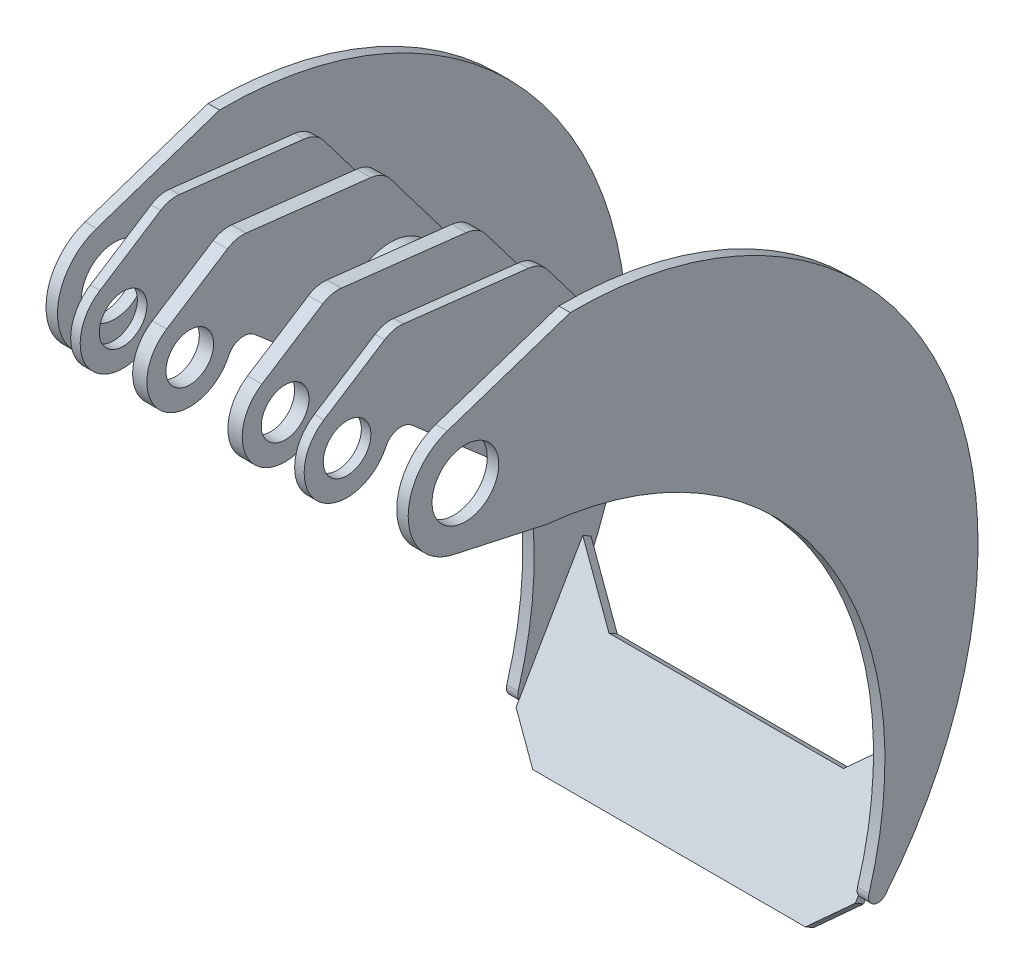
from build123d import *

# Parameters (mm, degrees)
SKIZZE1_R                            = 35
AUFSATZ_LINEAR_AUSTRAGEN1_DEPTH      = 12
AUFSATZ_LINEAR_AUSTRAGEN2_DEPTH      = 356
SKIZZE3_R                            = 35
AUFSATZ_LINEAR_AUSTRAGEN3_DEPTH      = 12
FASE1_SIZE                           = 35
SCHNITT_LINEAR_AUSTRAGEN1_DEPTH      = 866.735982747
SCHNITT_LINEAR_AUSTRAGEN1_DEPTH_BACK = 10
AUFSATZ_LINEAR_AUSTRAGEN8_REACH      = 910.889
SKIZZE6_R                            = 50
SKIZZE6_R_2                          = 42
AUFSATZ_LINEAR_START                 = -15
SKIZZE8_R                            = 50
SKIZZE8_R_2                          = 25
AUFSATZ_LINEAR_AUSTRAGEN9_DEPTH      = 15
AUFSATZ_LINEAR_START_2               = 10
SKIZZE9_R                            = 50
SKIZZE9_R_2                          = 25
AUFSATZ_LINEAR_AUSTRAGEN10_DEPTH     = 10


with BuildPart() as part:
    # Skizze1 → Aufsatz-Linear austragen1 (new body)
    with BuildSketch(Plane(origin=(0, 0, 0), x_dir=(0, 0, -1), z_dir=(1, 0, 0))):
        with BuildLine():
            Line((-19.008517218, 56.90936894), (110, 100))
            ThreePointArc((110, 100), (496.648056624, -141.604762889), (440.708308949, -594.087166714))
            ThreePointArc((440.708308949, -594.087166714), (428.276034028, -596.530629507), (423.42723475, -584.825027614))
            ThreePointArc((423.42723475, -584.825027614), (373.652002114, -252.342786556), (85, -80))
            Line((85, -80), (-12.81465141, -58.615567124))
            ThreePointArc((-12.81465141, -58.615567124), (-59.913948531, -3.212284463), (-19.008517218, 56.90936894))
        make_face()
        Circle(SKIZZE1_R, mode=Mode.SUBTRACT)
    extrude(amount=AUFSATZ_LINEAR_AUSTRAGEN1_DEPTH)

    # Skizze2 → Aufsatz-Linear austragen2 (add)
    with BuildSketch(Plane(origin=(12, 0, 0), x_dir=(0, 0, -1), z_dir=(1, 0, 0))):
        Polygon((412.330127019, -633.51803871), (499.830127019, -481.963593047), (491.169872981, -476.963593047), (403.669872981, -628.51803871), align=None)
    extrude(amount=AUFSATZ_LINEAR_AUSTRAGEN2_DEPTH)

    # Skizze3 → Aufsatz-Linear austragen3 (add)
    with BuildSketch(Plane(origin=(368, 0, 0), x_dir=(0, 0, -1), z_dir=(1, 0, 0))):
        with BuildLine():
            Line((110, 100), (-19.008517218, 56.90936894))
            ThreePointArc((-19.008517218, 56.90936894), (-59.913948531, -3.212284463), (-12.81465141, -58.615567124))
            Line((-12.81465141, -58.615567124), (85, -80))
            ThreePointArc((85, -80), (373.652002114, -252.342786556), (423.42723475, -584.825027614))
            ThreePointArc((423.42723475, -584.825027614), (428.276034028, -596.530629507), (440.708308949, -594.087166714))
            ThreePointArc((440.708308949, -594.087166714), (496.648056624, -141.604762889), (110, 100))
        make_face()
        Circle(SKIZZE3_R, mode=Mode.SUBTRACT)
    extrude(amount=AUFSATZ_LINEAR_AUSTRAGEN3_DEPTH)

    # Fase1
    fase1_edges = [part.edges().sort_by_distance(p)[0] for p in [
        (12, -631.01803871, -408),
        (368, -631.01803871, -408),
    ]]
    chamfer(fase1_edges, length=FASE1_SIZE)

    # Skizze4 → Schnitt-Linear austragen1 (cut, two sides: drawn at the far end of the back side and taken through both)
    with BuildSketch(Plane(origin=(0, -336.923692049, -583.568952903), x_dir=(-1, 0, 0), z_dir=(0, -0.4999999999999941, -0.8660254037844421)).offset(-SCHNITT_LINEAR_AUSTRAGEN1_DEPTH_BACK)):
        Polygon((-313, -222.477651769), (-67, -222.477651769), (-12, -167.477651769), (-368, -167.477651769), align=None)
    extrude(amount=SCHNITT_LINEAR_AUSTRAGEN1_DEPTH + SCHNITT_LINEAR_AUSTRAGEN1_DEPTH_BACK, mode=Mode.SUBTRACT)

    # Skizze6 → Aufsatz-Linear austragen8 (add, up to next)
    with BuildSketch(Plane(origin=(12, 0, 0), x_dir=(0, 0, -1), z_dir=(1, 0, 0)), mode=Mode.PRIVATE) as aufsatz_linear_austragen8_sk1:
        with Locations((153.824485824, -24.309157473)):
            Circle(SKIZZE6_R)
        with Locations((153.824485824, -24.309157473)):
            Circle(SKIZZE6_R_2, mode=Mode.SUBTRACT)
    aufsatz_linear_austragen8_tool1 = extrude(aufsatz_linear_austragen8_sk1.sketch, amount=AUFSATZ_LINEAR_AUSTRAGEN8_REACH, mode=Mode.PRIVATE) - part.part
    add(aufsatz_linear_austragen8_tool1.solids().sort_by_distance((12, -24.309157, -105.238699))[0])

    # Skizze8 → Aufsatz-Linear austragen9 (add)
    with BuildSketch(Plane(origin=(247.5, 0, 0), x_dir=(0, 0, -1), z_dir=(1, 0, 0)).offset(AUFSATZ_LINEAR_START)):
        with BuildLine():
            Line((205.607805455, 14.978089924), (153.899993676, 83.132575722))
            ThreePointArc((153.899993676, 83.132575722), (144.850654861, 91.066416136), (133.411410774, 94.805406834))
            Line((133.411410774, 94.805406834), (2.411410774, 109.79915659))
            ThreePointArc((2.411410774, 109.79915659), (-7.79723445, 109.213565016), (-17.216196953, 105.233301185))
            Line((-17.216196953, 105.233301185), (-80.96853212, 64.272968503))
            ThreePointArc((-80.96853212, 64.272968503), (-86.249671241, -7.47615423), (-15.860386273, 7.39581958))
            ThreePointArc((-15.860386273, 7.39581958), (-3.643093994, 17.11659622), (11.473871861, 13.213639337))
            Line((11.473871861, 13.213639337), (111.207247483, -73.388389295))
            ThreePointArc((111.207247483, -73.388389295), (198.244784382, -71.762682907), (205.607805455, 14.978089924))
        make_face()
        with Locations(Location((153.824485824, -24.309157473, 0), (0, 0, 180))):
            Circle(SKIZZE8_R, mode=Mode.SUBTRACT)
        with Locations((-56.64423669, 26.413641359)):
            Circle(SKIZZE8_R_2, mode=Mode.SUBTRACT)
    aufsatz_linear_austragen9 = extrude(amount=AUFSATZ_LINEAR_AUSTRAGEN9_DEPTH)

    # Skizze9 → Aufsatz-Linear austragen10 (add)
    with BuildSketch(Plane.ZY.offset(-312.5).offset(AUFSATZ_LINEAR_START_2)):
        with BuildLine():
            Line((-111.207247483, -73.388389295), (-11.473871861, 13.213639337))
            ThreePointArc((-11.473871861, 13.213639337), (3.643093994, 17.11659622), (15.860386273, 7.39581958))
            ThreePointArc((15.860386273, 7.39581958), (86.249671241, -7.47615423), (80.96853212, 64.272968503))
            Line((80.96853212, 64.272968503), (17.216196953, 105.233301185))
            ThreePointArc((17.216196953, 105.233301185), (7.79723445, 109.213565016), (-2.411410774, 109.79915659))
            Line((-2.411410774, 109.79915659), (-133.411410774, 94.805406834))
            ThreePointArc((-133.411410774, 94.805406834), (-144.850654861, 91.066416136), (-153.899993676, 83.132575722))
            Line((-153.899993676, 83.132575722), (-205.607805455, 14.978089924))
            ThreePointArc((-205.607805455, 14.978089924), (-198.244784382, -71.762682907), (-111.207247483, -73.388389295))
        make_face()
        with Locations((-153.824485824, -24.309157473)):
            Circle(SKIZZE9_R, mode=Mode.SUBTRACT)
        with Locations(Location((56.64423669, 26.413641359, 0), (0, 0, 180))):
            Circle(SKIZZE9_R_2, mode=Mode.SUBTRACT)
    aufsatz_linear_austragen10 = extrude(amount=-AUFSATZ_LINEAR_AUSTRAGEN10_DEPTH)

    # Spiegeln2: Aufsatz-Linear austragen9, Aufsatz-Linear austragen10 across plane
    add(aufsatz_linear_austragen9.mirror(Plane(origin=(190, 0, 0), x_dir=(0, 0, 1), z_dir=(1, 0, 0))))
    add(aufsatz_linear_austragen10.mirror(Plane(origin=(190, 0, 0), x_dir=(0, 0, 1), z_dir=(1, 0, 0))))


solid = part.part
